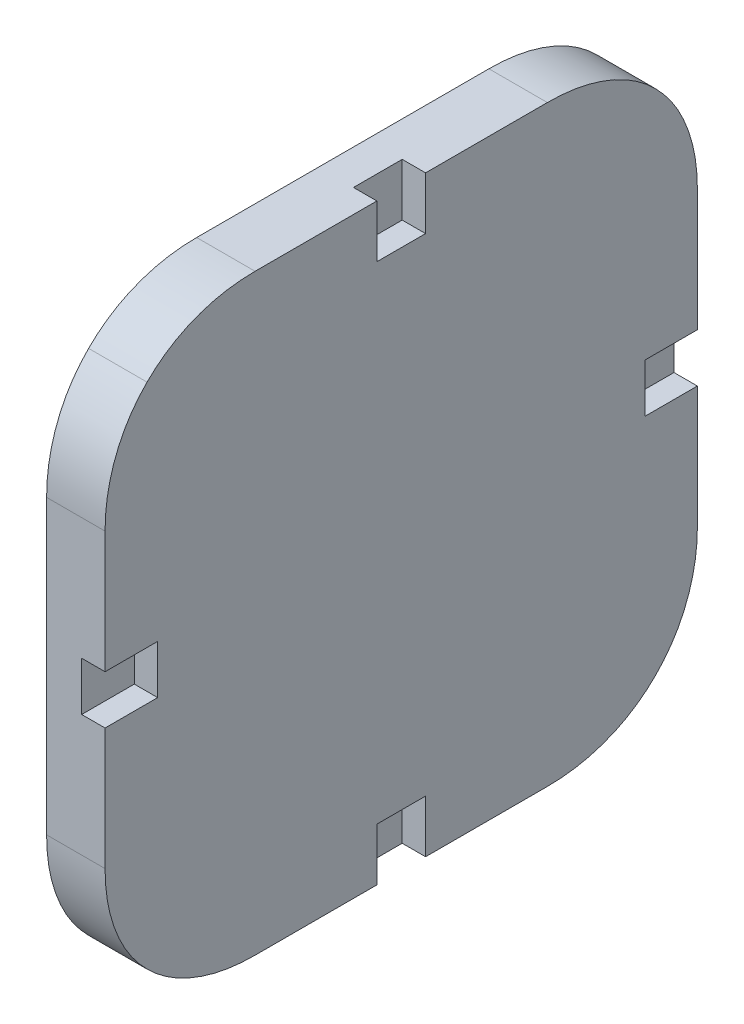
ISO-10303-21;
HEADER;
FILE_DESCRIPTION(('STEP AP214'),'2;1');
FILE_NAME('part.step','',(''),(''),'','','');
FILE_SCHEMA(('AUTOMOTIVE_DESIGN { 1 0 10303 214 1 1 1 1 }'));
ENDSEC;
DATA;
#1=APPLICATION_CONTEXT('core data for automotive mechanical design processes');
#2=APPLICATION_PROTOCOL_DEFINITION('international standard','automotive_design',2000,#1);
#3=PRODUCT_CONTEXT('',#1,'mechanical');
#4=PRODUCT('Part','Part','',(#3));
#5=PRODUCT_RELATED_PRODUCT_CATEGORY('part','',(#4));
#6=PRODUCT_DEFINITION_FORMATION('','',#4);
#7=PRODUCT_DEFINITION_CONTEXT('part definition',#1,'design');
#8=PRODUCT_DEFINITION('design','',#6,#7);
#9=PRODUCT_DEFINITION_SHAPE('','',#8);
#10=(LENGTH_UNIT() NAMED_UNIT(*) SI_UNIT(.MILLI.,.METRE.));
#11=(NAMED_UNIT(*) PLANE_ANGLE_UNIT() SI_UNIT($,.RADIAN.));
#12=(NAMED_UNIT(*) SI_UNIT($,.STERADIAN.) SOLID_ANGLE_UNIT());
#13=UNCERTAINTY_MEASURE_WITH_UNIT(LENGTH_MEASURE(1.E-05),#10,'distance_accuracy_value','');
#14=(GEOMETRIC_REPRESENTATION_CONTEXT(3) GLOBAL_UNCERTAINTY_ASSIGNED_CONTEXT((#13)) GLOBAL_UNIT_ASSIGNED_CONTEXT((#10,
#11,#12)) REPRESENTATION_CONTEXT('',''));
#15=CARTESIAN_POINT('',(0.,0.,0.));
#16=DIRECTION('',(0.,0.,1.));
#17=DIRECTION('',(1.,0.,0.));
#18=AXIS2_PLACEMENT_3D('',#15,#16,#17);
#19=CARTESIAN_POINT('',(20.5,32.1300644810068,10.6166229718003));
#20=DIRECTION('',(-1.,0.,0.));
#21=DIRECTION('',(0.,0.,1.));
#22=AXIS2_PLACEMENT_3D('',#19,#20,#21);
#23=PLANE('',#22);
#24=DIRECTION('',(0.,0.,-1.));
#25=VECTOR('',#24,1.);
#26=CARTESIAN_POINT('',(20.5,18.75,12.5));
#27=LINE('',#26,#25);
#28=CARTESIAN_POINT('',(20.5,18.75,15.2));
#29=VERTEX_POINT('',#28);
#30=CARTESIAN_POINT('',(20.5,18.75,12.5));
#31=VERTEX_POINT('',#30);
#32=EDGE_CURVE('E606',#29,#31,#27,.T.);
#33=ORIENTED_EDGE('',*,*,#32,.T.);
#34=DIRECTION('',(0.,-1.,0.));
#35=VECTOR('',#34,1.);
#36=CARTESIAN_POINT('',(20.5,18.75,12.5));
#37=LINE('',#36,#35);
#38=CARTESIAN_POINT('',(20.5,16.25,12.5));
#39=VERTEX_POINT('',#38);
#40=EDGE_CURVE('E601',#31,#39,#37,.T.);
#41=ORIENTED_EDGE('',*,*,#40,.T.);
#42=DIRECTION('',(0.,0.,1.));
#43=VECTOR('',#42,1.);
#44=CARTESIAN_POINT('',(20.5,16.25,12.5));
#45=LINE('',#44,#43);
#46=CARTESIAN_POINT('',(20.5,16.25,15.2));
#47=VERTEX_POINT('',#46);
#48=EDGE_CURVE('E604',#39,#47,#45,.T.);
#49=ORIENTED_EDGE('',*,*,#48,.T.);
#50=DIRECTION('',(0.,-1.,0.));
#51=VECTOR('',#50,1.);
#52=CARTESIAN_POINT('',(20.5,25.,15.2));
#53=LINE('',#52,#51);
#54=CARTESIAN_POINT('',(20.5,10.,15.2));
#55=VERTEX_POINT('',#54);
#56=EDGE_CURVE('E439',#47,#55,#53,.T.);
#57=ORIENTED_EDGE('',*,*,#56,.T.);
#58=CARTESIAN_POINT('',(20.5,10.,15.2));
#59=CARTESIAN_POINT('',(20.5,9.45802095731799,15.2));
#60=CARTESIAN_POINT('',(20.5,8.35553054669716,15.1065720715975));
#61=CARTESIAN_POINT('',(20.5,6.34909986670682,14.5244214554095));
#62=CARTESIAN_POINT('',(20.5,5.1383022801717,13.7287568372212));
#63=CARTESIAN_POINT('',(20.5,4.45477272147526,13.0452272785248));
#64=B_SPLINE_CURVE_WITH_KNOTS('',3,(#58,#59,#60,#61,#62,#63),.UNSPECIFIED.,.F.,.F.,(4,1,1,4),
(0.,0.25,0.5,1.),.UNSPECIFIED.);
#65=CARTESIAN_POINT('',(20.5,4.45477272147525,13.0452272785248));
#66=VERTEX_POINT('',#65);
#67=EDGE_CURVE('E436',#55,#66,#64,.T.);
#68=ORIENTED_EDGE('',*,*,#67,.T.);
#69=CARTESIAN_POINT('',(20.5,4.45477272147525,13.0452272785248));
#70=CARTESIAN_POINT('',(20.5,3.77123215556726,12.3616867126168));
#71=CARTESIAN_POINT('',(20.5,2.9758558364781,11.1572639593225));
#72=CARTESIAN_POINT('',(20.5,2.46578419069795,9.38667507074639));
#73=CARTESIAN_POINT('',(20.5,2.32408356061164,8.33370007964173));
#74=CARTESIAN_POINT('',(20.5,2.3,7.7755169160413));
#75=CARTESIAN_POINT('',(20.5,2.3,7.5));
#76=B_SPLINE_CURVE_WITH_KNOTS('',3,(#69,#70,#71,#72,#73,#74,#75),.UNSPECIFIED.,.F.,.F.,(4,1,1,1,
4),(0.,0.5,0.75,0.875,1.),.UNSPECIFIED.);
#77=CARTESIAN_POINT('',(20.5,2.3,7.5));
#78=VERTEX_POINT('',#77);
#79=EDGE_CURVE('E432',#66,#78,#76,.T.);
#80=ORIENTED_EDGE('',*,*,#79,.T.);
#81=DIRECTION('',(0.,0.,-1.));
#82=VECTOR('',#81,1.);
#83=CARTESIAN_POINT('',(20.5,2.3,7.5));
#84=LINE('',#83,#82);
#85=CARTESIAN_POINT('',(20.5,2.3,1.25));
#86=VERTEX_POINT('',#85);
#87=EDGE_CURVE('E883',#78,#86,#84,.T.);
#88=ORIENTED_EDGE('',*,*,#87,.T.);
#89=DIRECTION('',(0.,1.,0.));
#90=VECTOR('',#89,1.);
#91=CARTESIAN_POINT('',(20.5,5.,1.25));
#92=LINE('',#91,#90);
#93=CARTESIAN_POINT('',(20.5,5.,1.25));
#94=VERTEX_POINT('',#93);
#95=EDGE_CURVE('E557',#86,#94,#92,.T.);
#96=ORIENTED_EDGE('',*,*,#95,.T.);
#97=DIRECTION('',(0.,0.,-1.));
#98=VECTOR('',#97,1.);
#99=CARTESIAN_POINT('',(20.5,5.,1.25));
#100=LINE('',#99,#98);
#101=CARTESIAN_POINT('',(20.5,5.,-1.25));
#102=VERTEX_POINT('',#101);
#103=EDGE_CURVE('E550',#94,#102,#100,.T.);
#104=ORIENTED_EDGE('',*,*,#103,.T.);
#105=DIRECTION('',(0.,-1.,0.));
#106=VECTOR('',#105,1.);
#107=CARTESIAN_POINT('',(20.5,5.,-1.25));
#108=LINE('',#107,#106);
#109=CARTESIAN_POINT('',(20.5,2.3,-1.25));
#110=VERTEX_POINT('',#109);
#111=EDGE_CURVE('E554',#102,#110,#108,.T.);
#112=ORIENTED_EDGE('',*,*,#111,.T.);
#113=CARTESIAN_POINT('',(20.5,2.3,-7.5));
#114=VERTEX_POINT('',#113);
#115=EDGE_CURVE('E425',#110,#114,#84,.T.);
#116=ORIENTED_EDGE('',*,*,#115,.T.);
#117=CARTESIAN_POINT('',(20.5,2.3,-7.5));
#118=CARTESIAN_POINT('',(20.5,2.3,-8.04197904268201));
#119=CARTESIAN_POINT('',(20.5,2.39342792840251,-9.14446945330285));
#120=CARTESIAN_POINT('',(20.5,2.97557854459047,-11.1509001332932));
#121=CARTESIAN_POINT('',(20.5,3.77124316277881,-12.3616977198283));
#122=CARTESIAN_POINT('',(20.5,4.45477272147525,-13.0452272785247));
#123=B_SPLINE_CURVE_WITH_KNOTS('',3,(#117,#118,#119,#120,#121,#122),.UNSPECIFIED.,.F.,.F.,(4,1,
1,4),(0.,0.25,0.5,1.),.UNSPECIFIED.);
#124=CARTESIAN_POINT('',(20.5,4.45477272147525,-13.0452272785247));
#125=VERTEX_POINT('',#124);
#126=EDGE_CURVE('E419',#114,#125,#123,.T.);
#127=ORIENTED_EDGE('',*,*,#126,.T.);
#128=CARTESIAN_POINT('',(20.5,4.45477272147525,-13.0452272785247));
#129=CARTESIAN_POINT('',(20.5,5.13831328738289,-13.7287678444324));
#130=CARTESIAN_POINT('',(20.5,6.34273604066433,-14.5241441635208));
#131=CARTESIAN_POINT('',(20.5,8.11332492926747,-15.0342158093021));
#132=CARTESIAN_POINT('',(20.5,9.16629992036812,-15.1759164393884));
#133=CARTESIAN_POINT('',(20.5,9.72448308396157,-15.2));
#134=CARTESIAN_POINT('',(20.5,10.,-15.2));
#135=B_SPLINE_CURVE_WITH_KNOTS('',3,(#128,#129,#130,#131,#132,#133,#134),.UNSPECIFIED.,.F.,.F.,
(4,1,1,1,4),(0.,0.5,0.75,0.875,1.),.UNSPECIFIED.);
#136=CARTESIAN_POINT('',(20.5,10.,-15.2));
#137=VERTEX_POINT('',#136);
#138=EDGE_CURVE('E413',#125,#137,#135,.T.);
#139=ORIENTED_EDGE('',*,*,#138,.T.);
#140=DIRECTION('',(0.,1.,0.));
#141=VECTOR('',#140,1.);
#142=CARTESIAN_POINT('',(20.5,10.,-15.2));
#143=LINE('',#142,#141);
#144=CARTESIAN_POINT('',(20.5,16.25,-15.2));
#145=VERTEX_POINT('',#144);
#146=EDGE_CURVE('E409',#137,#145,#143,.T.);
#147=ORIENTED_EDGE('',*,*,#146,.T.);
#148=DIRECTION('',(0.,0.,-1.));
#149=VECTOR('',#148,1.);
#150=CARTESIAN_POINT('',(20.5,16.25,-12.5));
#151=LINE('',#150,#149);
#152=CARTESIAN_POINT('',(20.5,16.25,-12.5));
#153=VERTEX_POINT('',#152);
#154=EDGE_CURVE('E577',#153,#145,#151,.T.);
#155=ORIENTED_EDGE('',*,*,#154,.F.);
#156=DIRECTION('',(0.,-1.,0.));
#157=VECTOR('',#156,1.);
#158=CARTESIAN_POINT('',(20.5,18.75,-12.5));
#159=LINE('',#158,#157);
#160=CARTESIAN_POINT('',(20.5,18.75,-12.5));
#161=VERTEX_POINT('',#160);
#162=EDGE_CURVE('E580',#161,#153,#159,.T.);
#163=ORIENTED_EDGE('',*,*,#162,.F.);
#164=DIRECTION('',(0.,0.,1.));
#165=VECTOR('',#164,1.);
#166=CARTESIAN_POINT('',(20.5,18.75,-12.5));
#167=LINE('',#166,#165);
#168=CARTESIAN_POINT('',(20.5,18.75,-15.2));
#169=VERTEX_POINT('',#168);
#170=EDGE_CURVE('E583',#169,#161,#167,.T.);
#171=ORIENTED_EDGE('',*,*,#170,.F.);
#172=CARTESIAN_POINT('',(20.5,25.,-15.2));
#173=VERTEX_POINT('',#172);
#174=EDGE_CURVE('E870',#169,#173,#143,.T.);
#175=ORIENTED_EDGE('',*,*,#174,.T.);
#176=CARTESIAN_POINT('',(20.5,25.,-15.2));
#177=CARTESIAN_POINT('',(20.5,25.5419790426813,-15.2));
#178=CARTESIAN_POINT('',(20.5,26.644469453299,-15.1065720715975));
#179=CARTESIAN_POINT('',(20.5,28.650900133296,-14.5244214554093));
#180=CARTESIAN_POINT('',(20.5,29.8616977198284,-13.7287568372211));
#181=CARTESIAN_POINT('',(20.5,30.5452272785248,-13.0452272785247));
#182=B_SPLINE_CURVE_WITH_KNOTS('',3,(#176,#177,#178,#179,#180,#181),.UNSPECIFIED.,.F.,.F.,(4,1,
1,4),(0.,0.25,0.5,1.),.UNSPECIFIED.);
#183=CARTESIAN_POINT('',(20.5,30.5452272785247,-13.0452272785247));
#184=VERTEX_POINT('',#183);
#185=EDGE_CURVE('E493',#173,#184,#182,.T.);
#186=ORIENTED_EDGE('',*,*,#185,.T.);
#187=CARTESIAN_POINT('',(20.5,30.5452272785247,-13.0452272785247));
#188=CARTESIAN_POINT('',(20.5,31.2287678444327,-12.3616867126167));
#189=CARTESIAN_POINT('',(20.5,32.0241441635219,-11.1572639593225));
#190=CARTESIAN_POINT('',(20.5,32.534215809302,-9.38667507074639));
#191=CARTESIAN_POINT('',(20.5,32.6759164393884,-8.33370007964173));
#192=CARTESIAN_POINT('',(20.5,32.7,-7.7755169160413));
#193=CARTESIAN_POINT('',(20.5,32.7,-7.5));
#194=B_SPLINE_CURVE_WITH_KNOTS('',3,(#187,#188,#189,#190,#191,#192,#193),.UNSPECIFIED.,.F.,.F.,
(4,1,1,1,4),(0.,0.5,0.75,0.875,1.),.UNSPECIFIED.);
#195=CARTESIAN_POINT('',(20.5,32.7,-7.5));
#196=VERTEX_POINT('',#195);
#197=EDGE_CURVE('E488',#184,#196,#194,.T.);
#198=ORIENTED_EDGE('',*,*,#197,.T.);
#199=DIRECTION('',(0.,0.,1.));
#200=VECTOR('',#199,1.);
#201=CARTESIAN_POINT('',(20.5,32.7,-7.5));
#202=LINE('',#201,#200);
#203=CARTESIAN_POINT('',(20.5,32.7,-1.25));
#204=VERTEX_POINT('',#203);
#205=EDGE_CURVE('E293',#196,#204,#202,.T.);
#206=ORIENTED_EDGE('',*,*,#205,.T.);
#207=DIRECTION('',(0.,1.,0.));
#208=VECTOR('',#207,1.);
#209=CARTESIAN_POINT('',(20.5,30.,-1.25));
#210=LINE('',#209,#208);
#211=CARTESIAN_POINT('',(20.5,30.,-1.25));
#212=VERTEX_POINT('',#211);
#213=EDGE_CURVE('E523',#212,#204,#210,.T.);
#214=ORIENTED_EDGE('',*,*,#213,.F.);
#215=DIRECTION('',(0.,0.,-1.));
#216=VECTOR('',#215,1.);
#217=CARTESIAN_POINT('',(20.5,30.,1.25));
#218=LINE('',#217,#216);
#219=CARTESIAN_POINT('',(20.5,30.,1.25));
#220=VERTEX_POINT('',#219);
#221=EDGE_CURVE('E526',#220,#212,#218,.T.);
#222=ORIENTED_EDGE('',*,*,#221,.F.);
#223=DIRECTION('',(0.,-1.,0.));
#224=VECTOR('',#223,1.);
#225=CARTESIAN_POINT('',(20.5,30.,1.25));
#226=LINE('',#225,#224);
#227=CARTESIAN_POINT('',(20.5,32.7,1.25));
#228=VERTEX_POINT('',#227);
#229=EDGE_CURVE('E505',#228,#220,#226,.T.);
#230=ORIENTED_EDGE('',*,*,#229,.F.);
#231=CARTESIAN_POINT('',(20.5,32.7,7.5));
#232=VERTEX_POINT('',#231);
#233=EDGE_CURVE('E492',#228,#232,#202,.T.);
#234=ORIENTED_EDGE('',*,*,#233,.T.);
#235=CARTESIAN_POINT('',(20.5,32.7,7.5));
#236=CARTESIAN_POINT('',(20.5,32.7,8.04197904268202));
#237=CARTESIAN_POINT('',(20.5,32.6065720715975,9.14446945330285));
#238=CARTESIAN_POINT('',(20.5,32.0244214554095,11.1509001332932));
#239=CARTESIAN_POINT('',(20.5,31.2287568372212,12.3616977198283));
#240=CARTESIAN_POINT('',(20.5,30.5452272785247,13.0452272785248));
#241=B_SPLINE_CURVE_WITH_KNOTS('',3,(#235,#236,#237,#238,#239,#240),.UNSPECIFIED.,.F.,.F.,(4,1,
1,4),(0.,0.25,0.5,1.),.UNSPECIFIED.);
#242=CARTESIAN_POINT('',(20.5,30.5452272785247,13.0452272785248));
#243=VERTEX_POINT('',#242);
#244=EDGE_CURVE('E276',#232,#243,#241,.T.);
#245=ORIENTED_EDGE('',*,*,#244,.T.);
#246=CARTESIAN_POINT('',(20.5,30.5452272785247,13.0452272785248));
#247=CARTESIAN_POINT('',(20.5,29.8616867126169,13.7287678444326));
#248=CARTESIAN_POINT('',(20.5,28.6572639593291,14.5241441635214));
#249=CARTESIAN_POINT('',(20.5,26.8866750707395,15.0342158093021));
#250=CARTESIAN_POINT('',(20.5,25.8337000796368,15.1759164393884));
#251=CARTESIAN_POINT('',(20.5,25.2755169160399,15.2));
#252=CARTESIAN_POINT('',(20.5,25.,15.2));
#253=B_SPLINE_CURVE_WITH_KNOTS('',3,(#246,#247,#248,#249,#250,#251,#252),.UNSPECIFIED.,.F.,.F.,
(4,1,1,1,4),(0.,0.5,0.75,0.875,1.),.UNSPECIFIED.);
#254=CARTESIAN_POINT('',(20.5,25.,15.2));
#255=VERTEX_POINT('',#254);
#256=EDGE_CURVE('E333',#243,#255,#253,.T.);
#257=ORIENTED_EDGE('',*,*,#256,.T.);
#258=EDGE_CURVE('E329',#255,#29,#53,.T.);
#259=ORIENTED_EDGE('',*,*,#258,.T.);
#260=EDGE_LOOP('',(#33,#41,#49,#57,#68,#80,#88,#96,#104,#112,#116,#127,#139,#147,#155,#163,#171,
#175,#186,#198,#206,#214,#222,#230,#234,#245,#257,#259));
#261=FACE_BOUND('',#260,.T.);
#262=ADVANCED_FACE('F77',(#261),#23,.F.);
#263=CARTESIAN_POINT('',(20.5,25.,15.2));
#264=DIRECTION('',(0.,0.,-1.));
#265=DIRECTION('',(-1.,0.,0.));
#266=AXIS2_PLACEMENT_3D('',#263,#264,#265);
#267=PLANE('',#266);
#268=DIRECTION('',(1.,0.,0.));
#269=VECTOR('',#268,1.);
#270=CARTESIAN_POINT('',(19.3,18.75,15.2));
#271=LINE('',#270,#269);
#272=CARTESIAN_POINT('',(19.3,18.75,15.2));
#273=VERTEX_POINT('',#272);
#274=EDGE_CURVE('E593',#273,#29,#271,.T.);
#275=ORIENTED_EDGE('',*,*,#274,.T.);
#276=ORIENTED_EDGE('',*,*,#258,.F.);
#277=DIRECTION('',(-1.,0.,0.));
#278=VECTOR('',#277,1.);
#279=CARTESIAN_POINT('',(20.5,25.,15.2));
#280=LINE('',#279,#278);
#281=CARTESIAN_POINT('',(17.5,25.,15.2));
#282=VERTEX_POINT('',#281);
#283=EDGE_CURVE('E86',#255,#282,#280,.T.);
#284=ORIENTED_EDGE('',*,*,#283,.T.);
#285=DIRECTION('',(0.,-1.,0.));
#286=VECTOR('',#285,1.);
#287=CARTESIAN_POINT('',(17.5,25.,15.2));
#288=LINE('',#287,#286);
#289=CARTESIAN_POINT('',(17.5,10.,15.2));
#290=VERTEX_POINT('',#289);
#291=EDGE_CURVE('E327',#282,#290,#288,.T.);
#292=ORIENTED_EDGE('',*,*,#291,.T.);
#293=DIRECTION('',(-1.,0.,0.));
#294=VECTOR('',#293,1.);
#295=CARTESIAN_POINT('',(20.5,10.,15.2));
#296=LINE('',#295,#294);
#297=EDGE_CURVE('E317',#55,#290,#296,.T.);
#298=ORIENTED_EDGE('',*,*,#297,.F.);
#299=ORIENTED_EDGE('',*,*,#56,.F.);
#300=DIRECTION('',(1.,0.,0.));
#301=VECTOR('',#300,1.);
#302=CARTESIAN_POINT('',(19.3,16.25,15.2));
#303=LINE('',#302,#301);
#304=CARTESIAN_POINT('',(19.3,16.25,15.2));
#305=VERTEX_POINT('',#304);
#306=EDGE_CURVE('E441',#305,#47,#303,.T.);
#307=ORIENTED_EDGE('',*,*,#306,.F.);
#308=DIRECTION('',(0.,1.,0.));
#309=VECTOR('',#308,1.);
#310=CARTESIAN_POINT('',(19.3,18.75,15.2));
#311=LINE('',#310,#309);
#312=EDGE_CURVE('E611',#305,#273,#311,.T.);
#313=ORIENTED_EDGE('',*,*,#312,.T.);
#314=EDGE_LOOP('',(#275,#276,#284,#292,#298,#299,#307,#313));
#315=FACE_BOUND('',#314,.T.);
#316=ADVANCED_FACE('F325',(#315),#267,.F.);
#317=CARTESIAN_POINT('',(20.5,2.3,7.5));
#318=DIRECTION('',(0.,1.,0.));
#319=DIRECTION('',(0.,0.,1.));
#320=AXIS2_PLACEMENT_3D('',#317,#318,#319);
#321=PLANE('',#320);
#322=DIRECTION('',(1.,0.,0.));
#323=VECTOR('',#322,1.);
#324=CARTESIAN_POINT('',(19.3,2.30000000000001,1.25));
#325=LINE('',#324,#323);
#326=CARTESIAN_POINT('',(19.3,2.30000000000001,1.25));
#327=VERTEX_POINT('',#326);
#328=EDGE_CURVE('E541',#327,#86,#325,.T.);
#329=ORIENTED_EDGE('',*,*,#328,.T.);
#330=ORIENTED_EDGE('',*,*,#87,.F.);
#331=DIRECTION('',(-1.,0.,0.));
#332=VECTOR('',#331,1.);
#333=CARTESIAN_POINT('',(20.5,2.3,7.5));
#334=LINE('',#333,#332);
#335=CARTESIAN_POINT('',(17.5,2.3,7.5));
#336=VERTEX_POINT('',#335);
#337=EDGE_CURVE('E311',#78,#336,#334,.T.);
#338=ORIENTED_EDGE('',*,*,#337,.T.);
#339=DIRECTION('',(0.,0.,-1.));
#340=VECTOR('',#339,1.);
#341=CARTESIAN_POINT('',(17.5,2.3,7.5));
#342=LINE('',#341,#340);
#343=CARTESIAN_POINT('',(17.5,2.3,-7.5));
#344=VERTEX_POINT('',#343);
#345=EDGE_CURVE('E363',#336,#344,#342,.T.);
#346=ORIENTED_EDGE('',*,*,#345,.T.);
#347=DIRECTION('',(-1.,0.,0.));
#348=VECTOR('',#347,1.);
#349=CARTESIAN_POINT('',(20.5,2.3,-7.5));
#350=LINE('',#349,#348);
#351=EDGE_CURVE('E308',#114,#344,#350,.T.);
#352=ORIENTED_EDGE('',*,*,#351,.F.);
#353=ORIENTED_EDGE('',*,*,#115,.F.);
#354=DIRECTION('',(1.,0.,0.));
#355=VECTOR('',#354,1.);
#356=CARTESIAN_POINT('',(19.3,2.30000000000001,-1.25));
#357=LINE('',#356,#355);
#358=CARTESIAN_POINT('',(19.3,2.30000000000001,-1.25));
#359=VERTEX_POINT('',#358);
#360=EDGE_CURVE('E543',#359,#110,#357,.T.);
#361=ORIENTED_EDGE('',*,*,#360,.F.);
#362=DIRECTION('',(0.,0.,1.));
#363=VECTOR('',#362,1.);
#364=CARTESIAN_POINT('',(19.3,2.30000000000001,1.25));
#365=LINE('',#364,#363);
#366=EDGE_CURVE('E564',#359,#327,#365,.T.);
#367=ORIENTED_EDGE('',*,*,#366,.T.);
#368=EDGE_LOOP('',(#329,#330,#338,#346,#352,#353,#361,#367));
#369=FACE_BOUND('',#368,.T.);
#370=ADVANCED_FACE('F423',(#369),#321,.F.);
#371=DIRECTION('',(-1.,0.,0.));
#372=VECTOR('',#371,1.);
#373=SURFACE_OF_LINEAR_EXTRUSION('',#241,#372);
#374=CARTESIAN_POINT('',(17.5,32.7,7.5));
#375=CARTESIAN_POINT('',(17.5,32.7,8.04197904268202));
#376=CARTESIAN_POINT('',(17.5,32.6065720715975,9.14446945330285));
#377=CARTESIAN_POINT('',(17.5,32.0244214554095,11.1509001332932));
#378=CARTESIAN_POINT('',(17.5,31.2287568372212,12.3616977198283));
#379=CARTESIAN_POINT('',(17.5,30.5452272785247,13.0452272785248));
#380=B_SPLINE_CURVE_WITH_KNOTS('',3,(#374,#375,#376,#377,#378,#379),.UNSPECIFIED.,.F.,.F.,(4,1,
1,4),(0.,0.25,0.5,1.),.UNSPECIFIED.);
#381=CARTESIAN_POINT('',(17.5,32.7,7.5));
#382=VERTEX_POINT('',#381);
#383=CARTESIAN_POINT('',(17.5,30.5452272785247,13.0452272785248));
#384=VERTEX_POINT('',#383);
#385=EDGE_CURVE('E271',#382,#384,#380,.T.);
#386=ORIENTED_EDGE('',*,*,#385,.T.);
#387=DIRECTION('',(-1.,0.,0.));
#388=VECTOR('',#387,1.);
#389=CARTESIAN_POINT('',(20.5,30.5452272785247,13.0452272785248));
#390=LINE('',#389,#388);
#391=EDGE_CURVE('E13',#243,#384,#390,.T.);
#392=ORIENTED_EDGE('',*,*,#391,.F.);
#393=ORIENTED_EDGE('',*,*,#244,.F.);
#394=DIRECTION('',(-1.,0.,0.));
#395=VECTOR('',#394,1.);
#396=CARTESIAN_POINT('',(20.5,32.7,7.5));
#397=LINE('',#396,#395);
#398=EDGE_CURVE('E294',#232,#382,#397,.T.);
#399=ORIENTED_EDGE('',*,*,#398,.T.);
#400=EDGE_LOOP('',(#386,#392,#393,#399));
#401=FACE_BOUND('',#400,.T.);
#402=ADVANCED_FACE('F79',(#401),#373,.F.);
#403=DIRECTION('',(-1.,0.,0.));
#404=VECTOR('',#403,1.);
#405=SURFACE_OF_LINEAR_EXTRUSION('',#253,#404);
#406=CARTESIAN_POINT('',(17.5,30.5452272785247,13.0452272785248));
#407=CARTESIAN_POINT('',(17.5,29.8616867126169,13.7287678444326));
#408=CARTESIAN_POINT('',(17.5,28.6572639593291,14.5241441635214));
#409=CARTESIAN_POINT('',(17.5,26.8866750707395,15.0342158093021));
#410=CARTESIAN_POINT('',(17.5,25.8337000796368,15.1759164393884));
#411=CARTESIAN_POINT('',(17.5,25.2755169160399,15.2));
#412=CARTESIAN_POINT('',(17.5,25.,15.2));
#413=B_SPLINE_CURVE_WITH_KNOTS('',3,(#406,#407,#408,#409,#410,#411,#412),.UNSPECIFIED.,.F.,.F.,
(4,1,1,1,4),(0.,0.5,0.75,0.875,1.),.UNSPECIFIED.);
#414=EDGE_CURVE('E335',#384,#282,#413,.T.);
#415=ORIENTED_EDGE('',*,*,#414,.T.);
#416=ORIENTED_EDGE('',*,*,#283,.F.);
#417=ORIENTED_EDGE('',*,*,#256,.F.);
#418=ORIENTED_EDGE('',*,*,#391,.T.);
#419=EDGE_LOOP('',(#415,#416,#417,#418));
#420=FACE_BOUND('',#419,.T.);
#421=ADVANCED_FACE('F332',(#420),#405,.F.);
#422=DIRECTION('',(-1.,0.,0.));
#423=VECTOR('',#422,1.);
#424=SURFACE_OF_LINEAR_EXTRUSION('',#64,#423);
#425=CARTESIAN_POINT('',(17.5,10.,15.2));
#426=CARTESIAN_POINT('',(17.5,9.45802095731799,15.2));
#427=CARTESIAN_POINT('',(17.5,8.35553054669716,15.1065720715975));
#428=CARTESIAN_POINT('',(17.5,6.34909986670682,14.5244214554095));
#429=CARTESIAN_POINT('',(17.5,5.1383022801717,13.7287568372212));
#430=CARTESIAN_POINT('',(17.5,4.45477272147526,13.0452272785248));
#431=B_SPLINE_CURVE_WITH_KNOTS('',3,(#425,#426,#427,#428,#429,#430),.UNSPECIFIED.,.F.,.F.,(4,1,
1,4),(0.,0.25,0.5,1.),.UNSPECIFIED.);
#432=CARTESIAN_POINT('',(17.5,4.45477272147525,13.0452272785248));
#433=VERTEX_POINT('',#432);
#434=EDGE_CURVE('E338',#290,#433,#431,.T.);
#435=ORIENTED_EDGE('',*,*,#434,.T.);
#436=DIRECTION('',(-1.,0.,0.));
#437=VECTOR('',#436,1.);
#438=CARTESIAN_POINT('',(20.5,4.45477272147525,13.0452272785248));
#439=LINE('',#438,#437);
#440=EDGE_CURVE('E314',#66,#433,#439,.T.);
#441=ORIENTED_EDGE('',*,*,#440,.F.);
#442=ORIENTED_EDGE('',*,*,#67,.F.);
#443=ORIENTED_EDGE('',*,*,#297,.T.);
#444=EDGE_LOOP('',(#435,#441,#442,#443));
#445=FACE_BOUND('',#444,.T.);
#446=ADVANCED_FACE('F435',(#445),#424,.F.);
#447=DIRECTION('',(-1.,0.,0.));
#448=VECTOR('',#447,1.);
#449=SURFACE_OF_LINEAR_EXTRUSION('',#76,#448);
#450=CARTESIAN_POINT('',(17.5,4.45477272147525,13.0452272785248));
#451=CARTESIAN_POINT('',(17.5,3.77123215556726,12.3616867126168));
#452=CARTESIAN_POINT('',(17.5,2.9758558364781,11.1572639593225));
#453=CARTESIAN_POINT('',(17.5,2.46578419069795,9.38667507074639));
#454=CARTESIAN_POINT('',(17.5,2.32408356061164,8.33370007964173));
#455=CARTESIAN_POINT('',(17.5,2.3,7.7755169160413));
#456=CARTESIAN_POINT('',(17.5,2.3,7.5));
#457=B_SPLINE_CURVE_WITH_KNOTS('',3,(#450,#451,#452,#453,#454,#455,#456),.UNSPECIFIED.,.F.,.F.,
(4,1,1,1,4),(0.,0.5,0.75,0.875,1.),.UNSPECIFIED.);
#458=EDGE_CURVE('E355',#433,#336,#457,.T.);
#459=ORIENTED_EDGE('',*,*,#458,.T.);
#460=ORIENTED_EDGE('',*,*,#337,.F.);
#461=ORIENTED_EDGE('',*,*,#79,.F.);
#462=ORIENTED_EDGE('',*,*,#440,.T.);
#463=EDGE_LOOP('',(#459,#460,#461,#462));
#464=FACE_BOUND('',#463,.T.);
#465=ADVANCED_FACE('F429',(#464),#449,.F.);
#466=DIRECTION('',(-1.,0.,0.));
#467=VECTOR('',#466,1.);
#468=SURFACE_OF_LINEAR_EXTRUSION('',#123,#467);
#469=CARTESIAN_POINT('',(17.5,2.3,-7.5));
#470=CARTESIAN_POINT('',(17.5,2.3,-8.04197904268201));
#471=CARTESIAN_POINT('',(17.5,2.39342792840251,-9.14446945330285));
#472=CARTESIAN_POINT('',(17.5,2.97557854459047,-11.1509001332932));
#473=CARTESIAN_POINT('',(17.5,3.77124316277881,-12.3616977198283));
#474=CARTESIAN_POINT('',(17.5,4.45477272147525,-13.0452272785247));
#475=B_SPLINE_CURVE_WITH_KNOTS('',3,(#469,#470,#471,#472,#473,#474),.UNSPECIFIED.,.F.,.F.,(4,1,
1,4),(0.,0.25,0.5,1.),.UNSPECIFIED.);
#476=CARTESIAN_POINT('',(17.5,4.45477272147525,-13.0452272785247));
#477=VERTEX_POINT('',#476);
#478=EDGE_CURVE('E369',#344,#477,#475,.T.);
#479=ORIENTED_EDGE('',*,*,#478,.T.);
#480=DIRECTION('',(-1.,0.,0.));
#481=VECTOR('',#480,1.);
#482=CARTESIAN_POINT('',(20.5,4.45477272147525,-13.0452272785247));
#483=LINE('',#482,#481);
#484=EDGE_CURVE('E305',#125,#477,#483,.T.);
#485=ORIENTED_EDGE('',*,*,#484,.F.);
#486=ORIENTED_EDGE('',*,*,#126,.F.);
#487=ORIENTED_EDGE('',*,*,#351,.T.);
#488=EDGE_LOOP('',(#479,#485,#486,#487));
#489=FACE_BOUND('',#488,.T.);
#490=ADVANCED_FACE('F416',(#489),#468,.F.);
#491=DIRECTION('',(-1.,0.,0.));
#492=VECTOR('',#491,1.);
#493=SURFACE_OF_LINEAR_EXTRUSION('',#135,#492);
#494=CARTESIAN_POINT('',(17.5,4.45477272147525,-13.0452272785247));
#495=CARTESIAN_POINT('',(17.5,5.13831328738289,-13.7287678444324));
#496=CARTESIAN_POINT('',(17.5,6.34273604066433,-14.5241441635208));
#497=CARTESIAN_POINT('',(17.5,8.11332492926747,-15.0342158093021));
#498=CARTESIAN_POINT('',(17.5,9.16629992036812,-15.1759164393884));
#499=CARTESIAN_POINT('',(17.5,9.72448308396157,-15.2));
#500=CARTESIAN_POINT('',(17.5,10.,-15.2));
#501=B_SPLINE_CURVE_WITH_KNOTS('',3,(#494,#495,#496,#497,#498,#499,#500),.UNSPECIFIED.,.F.,.F.,
(4,1,1,1,4),(0.,0.5,0.75,0.875,1.),.UNSPECIFIED.);
#502=CARTESIAN_POINT('',(17.5,10.,-15.2));
#503=VERTEX_POINT('',#502);
#504=EDGE_CURVE('E374',#477,#503,#501,.T.);
#505=ORIENTED_EDGE('',*,*,#504,.T.);
#506=DIRECTION('',(-1.,0.,0.));
#507=VECTOR('',#506,1.);
#508=CARTESIAN_POINT('',(20.5,10.,-15.2));
#509=LINE('',#508,#507);
#510=EDGE_CURVE('E302',#137,#503,#509,.T.);
#511=ORIENTED_EDGE('',*,*,#510,.F.);
#512=ORIENTED_EDGE('',*,*,#138,.F.);
#513=ORIENTED_EDGE('',*,*,#484,.T.);
#514=EDGE_LOOP('',(#505,#511,#512,#513));
#515=FACE_BOUND('',#514,.T.);
#516=ADVANCED_FACE('F412',(#515),#493,.F.);
#517=CARTESIAN_POINT('',(20.5,10.,-15.2));
#518=DIRECTION('',(0.,0.,1.));
#519=DIRECTION('',(1.,0.,0.));
#520=AXIS2_PLACEMENT_3D('',#517,#518,#519);
#521=PLANE('',#520);
#522=ORIENTED_EDGE('',*,*,#174,.F.);
#523=DIRECTION('',(1.,0.,0.));
#524=VECTOR('',#523,1.);
#525=CARTESIAN_POINT('',(19.3,18.75,-15.2));
#526=LINE('',#525,#524);
#527=CARTESIAN_POINT('',(19.3,18.75,-15.2));
#528=VERTEX_POINT('',#527);
#529=EDGE_CURVE('E560',#528,#169,#526,.T.);
#530=ORIENTED_EDGE('',*,*,#529,.F.);
#531=DIRECTION('',(0.,1.,0.));
#532=VECTOR('',#531,1.);
#533=CARTESIAN_POINT('',(19.3,18.75,-15.2));
#534=LINE('',#533,#532);
#535=CARTESIAN_POINT('',(19.3,16.25,-15.2));
#536=VERTEX_POINT('',#535);
#537=EDGE_CURVE('E572',#536,#528,#534,.T.);
#538=ORIENTED_EDGE('',*,*,#537,.F.);
#539=DIRECTION('',(1.,0.,0.));
#540=VECTOR('',#539,1.);
#541=CARTESIAN_POINT('',(19.3,16.25,-15.2));
#542=LINE('',#541,#540);
#543=EDGE_CURVE('E574',#536,#145,#542,.T.);
#544=ORIENTED_EDGE('',*,*,#543,.T.);
#545=ORIENTED_EDGE('',*,*,#146,.F.);
#546=ORIENTED_EDGE('',*,*,#510,.T.);
#547=DIRECTION('',(0.,1.,0.));
#548=VECTOR('',#547,1.);
#549=CARTESIAN_POINT('',(17.5,10.,-15.2));
#550=LINE('',#549,#548);
#551=CARTESIAN_POINT('',(17.5,25.,-15.2));
#552=VERTEX_POINT('',#551);
#553=EDGE_CURVE('E382',#503,#552,#550,.T.);
#554=ORIENTED_EDGE('',*,*,#553,.T.);
#555=DIRECTION('',(-1.,0.,0.));
#556=VECTOR('',#555,1.);
#557=CARTESIAN_POINT('',(20.5,25.,-15.2));
#558=LINE('',#557,#556);
#559=EDGE_CURVE('E296',#173,#552,#558,.T.);
#560=ORIENTED_EDGE('',*,*,#559,.F.);
#561=EDGE_LOOP('',(#522,#530,#538,#544,#545,#546,#554,#560));
#562=FACE_BOUND('',#561,.T.);
#563=ADVANCED_FACE('F404',(#562),#521,.F.);
#564=DIRECTION('',(-1.,0.,0.));
#565=VECTOR('',#564,1.);
#566=SURFACE_OF_LINEAR_EXTRUSION('',#182,#565);
#567=CARTESIAN_POINT('',(17.5,25.,-15.2));
#568=CARTESIAN_POINT('',(17.5,25.5419790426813,-15.2));
#569=CARTESIAN_POINT('',(17.5,26.644469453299,-15.1065720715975));
#570=CARTESIAN_POINT('',(17.5,28.650900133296,-14.5244214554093));
#571=CARTESIAN_POINT('',(17.5,29.8616977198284,-13.7287568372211));
#572=CARTESIAN_POINT('',(17.5,30.5452272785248,-13.0452272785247));
#573=B_SPLINE_CURVE_WITH_KNOTS('',3,(#567,#568,#569,#570,#571,#572),.UNSPECIFIED.,.F.,.F.,(4,1,
1,4),(0.,0.25,0.5,1.),.UNSPECIFIED.);
#574=CARTESIAN_POINT('',(17.5,30.5452272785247,-13.0452272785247));
#575=VERTEX_POINT('',#574);
#576=EDGE_CURVE('E287',#552,#575,#573,.T.);
#577=ORIENTED_EDGE('',*,*,#576,.T.);
#578=DIRECTION('',(-1.,0.,0.));
#579=VECTOR('',#578,1.);
#580=CARTESIAN_POINT('',(20.5,30.5452272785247,-13.0452272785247));
#581=LINE('',#580,#579);
#582=EDGE_CURVE('E286',#184,#575,#581,.T.);
#583=ORIENTED_EDGE('',*,*,#582,.F.);
#584=ORIENTED_EDGE('',*,*,#185,.F.);
#585=ORIENTED_EDGE('',*,*,#559,.T.);
#586=EDGE_LOOP('',(#577,#583,#584,#585));
#587=FACE_BOUND('',#586,.T.);
#588=ADVANCED_FACE('F399',(#587),#566,.F.);
#589=DIRECTION('',(-1.,0.,0.));
#590=VECTOR('',#589,1.);
#591=SURFACE_OF_LINEAR_EXTRUSION('',#194,#590);
#592=CARTESIAN_POINT('',(17.5,30.5452272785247,-13.0452272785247));
#593=CARTESIAN_POINT('',(17.5,31.2287678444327,-12.3616867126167));
#594=CARTESIAN_POINT('',(17.5,32.0241441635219,-11.1572639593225));
#595=CARTESIAN_POINT('',(17.5,32.534215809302,-9.38667507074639));
#596=CARTESIAN_POINT('',(17.5,32.6759164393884,-8.33370007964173));
#597=CARTESIAN_POINT('',(17.5,32.7,-7.7755169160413));
#598=CARTESIAN_POINT('',(17.5,32.7,-7.5));
#599=B_SPLINE_CURVE_WITH_KNOTS('',3,(#592,#593,#594,#595,#596,#597,#598),.UNSPECIFIED.,.F.,.F.,
(4,1,1,1,4),(0.,0.5,0.75,0.875,1.),.UNSPECIFIED.);
#600=CARTESIAN_POINT('',(17.5,32.7,-7.5));
#601=VERTEX_POINT('',#600);
#602=EDGE_CURVE('E268',#575,#601,#599,.T.);
#603=ORIENTED_EDGE('',*,*,#602,.T.);
#604=DIRECTION('',(-1.,0.,0.));
#605=VECTOR('',#604,1.);
#606=CARTESIAN_POINT('',(20.5,32.7,-7.5));
#607=LINE('',#606,#605);
#608=EDGE_CURVE('E283',#196,#601,#607,.T.);
#609=ORIENTED_EDGE('',*,*,#608,.F.);
#610=ORIENTED_EDGE('',*,*,#197,.F.);
#611=ORIENTED_EDGE('',*,*,#582,.T.);
#612=EDGE_LOOP('',(#603,#609,#610,#611));
#613=FACE_BOUND('',#612,.T.);
#614=ADVANCED_FACE('F281',(#613),#591,.F.);
#615=CARTESIAN_POINT('',(20.5,32.7,-7.5));
#616=DIRECTION('',(0.,-1.,0.));
#617=DIRECTION('',(0.,0.,-1.));
#618=AXIS2_PLACEMENT_3D('',#615,#616,#617);
#619=PLANE('',#618);
#620=ORIENTED_EDGE('',*,*,#233,.F.);
#621=DIRECTION('',(1.,0.,0.));
#622=VECTOR('',#621,1.);
#623=CARTESIAN_POINT('',(19.3,32.7,1.25));
#624=LINE('',#623,#622);
#625=CARTESIAN_POINT('',(19.3,32.7,1.25));
#626=VERTEX_POINT('',#625);
#627=EDGE_CURVE('E340',#626,#228,#624,.T.);
#628=ORIENTED_EDGE('',*,*,#627,.F.);
#629=DIRECTION('',(0.,0.,1.));
#630=VECTOR('',#629,1.);
#631=CARTESIAN_POINT('',(19.3,32.7,1.25));
#632=LINE('',#631,#630);
#633=CARTESIAN_POINT('',(19.3,32.7,-1.25));
#634=VERTEX_POINT('',#633);
#635=EDGE_CURVE('E518',#634,#626,#632,.T.);
#636=ORIENTED_EDGE('',*,*,#635,.F.);
#637=DIRECTION('',(1.,0.,0.));
#638=VECTOR('',#637,1.);
#639=CARTESIAN_POINT('',(19.3,32.7,-1.25));
#640=LINE('',#639,#638);
#641=EDGE_CURVE('E520',#634,#204,#640,.T.);
#642=ORIENTED_EDGE('',*,*,#641,.T.);
#643=ORIENTED_EDGE('',*,*,#205,.F.);
#644=ORIENTED_EDGE('',*,*,#608,.T.);
#645=DIRECTION('',(0.,0.,1.));
#646=VECTOR('',#645,1.);
#647=CARTESIAN_POINT('',(17.5,32.7,-7.5));
#648=LINE('',#647,#646);
#649=EDGE_CURVE('E265',#601,#382,#648,.T.);
#650=ORIENTED_EDGE('',*,*,#649,.T.);
#651=ORIENTED_EDGE('',*,*,#398,.F.);
#652=EDGE_LOOP('',(#620,#628,#636,#642,#643,#644,#650,#651));
#653=FACE_BOUND('',#652,.T.);
#654=ADVANCED_FACE('F290',(#653),#619,.F.);
#655=CARTESIAN_POINT('',(19.3,30.,1.25));
#656=DIRECTION('',(0.,0.,1.));
#657=DIRECTION('',(0.,-1.,0.));
#658=AXIS2_PLACEMENT_3D('',#655,#656,#657);
#659=PLANE('',#658);
#660=ORIENTED_EDGE('',*,*,#229,.T.);
#661=DIRECTION('',(1.,0.,0.));
#662=VECTOR('',#661,1.);
#663=CARTESIAN_POINT('',(19.3,30.,1.25));
#664=LINE('',#663,#662);
#665=CARTESIAN_POINT('',(19.3,30.,1.25));
#666=VERTEX_POINT('',#665);
#667=EDGE_CURVE('E511',#666,#220,#664,.T.);
#668=ORIENTED_EDGE('',*,*,#667,.F.);
#669=DIRECTION('',(0.,-1.,0.));
#670=VECTOR('',#669,1.);
#671=CARTESIAN_POINT('',(19.3,30.,1.25));
#672=LINE('',#671,#670);
#673=EDGE_CURVE('E525',#626,#666,#672,.T.);
#674=ORIENTED_EDGE('',*,*,#673,.F.);
#675=ORIENTED_EDGE('',*,*,#627,.T.);
#676=EDGE_LOOP('',(#660,#668,#674,#675));
#677=FACE_BOUND('',#676,.T.);
#678=ADVANCED_FACE('F479',(#677),#659,.F.);
#679=CARTESIAN_POINT('',(19.3,30.,-1.25));
#680=DIRECTION('',(0.,0.,-1.));
#681=DIRECTION('',(0.,1.,0.));
#682=AXIS2_PLACEMENT_3D('',#679,#680,#681);
#683=PLANE('',#682);
#684=ORIENTED_EDGE('',*,*,#213,.T.);
#685=ORIENTED_EDGE('',*,*,#641,.F.);
#686=DIRECTION('',(0.,1.,0.));
#687=VECTOR('',#686,1.);
#688=CARTESIAN_POINT('',(19.3,30.,-1.25));
#689=LINE('',#688,#687);
#690=CARTESIAN_POINT('',(19.3,30.,-1.25));
#691=VERTEX_POINT('',#690);
#692=EDGE_CURVE('E533',#691,#634,#689,.T.);
#693=ORIENTED_EDGE('',*,*,#692,.F.);
#694=DIRECTION('',(1.,0.,0.));
#695=VECTOR('',#694,1.);
#696=CARTESIAN_POINT('',(19.3,30.,-1.25));
#697=LINE('',#696,#695);
#698=EDGE_CURVE('E517',#691,#212,#697,.T.);
#699=ORIENTED_EDGE('',*,*,#698,.T.);
#700=EDGE_LOOP('',(#684,#685,#693,#699));
#701=FACE_BOUND('',#700,.T.);
#702=ADVANCED_FACE('F671',(#701),#683,.F.);
#703=CARTESIAN_POINT('',(19.3,30.,1.25));
#704=DIRECTION('',(0.,-1.,0.));
#705=DIRECTION('',(0.,0.,-1.));
#706=AXIS2_PLACEMENT_3D('',#703,#704,#705);
#707=PLANE('',#706);
#708=ORIENTED_EDGE('',*,*,#221,.T.);
#709=ORIENTED_EDGE('',*,*,#698,.F.);
#710=DIRECTION('',(0.,0.,-1.));
#711=VECTOR('',#710,1.);
#712=CARTESIAN_POINT('',(19.3,30.,1.25));
#713=LINE('',#712,#711);
#714=EDGE_CURVE('E536',#666,#691,#713,.T.);
#715=ORIENTED_EDGE('',*,*,#714,.F.);
#716=ORIENTED_EDGE('',*,*,#667,.T.);
#717=EDGE_LOOP('',(#708,#709,#715,#716));
#718=FACE_BOUND('',#717,.T.);
#719=ADVANCED_FACE('F669',(#718),#707,.F.);
#720=CARTESIAN_POINT('',(19.3,0.,0.));
#721=DIRECTION('',(-1.,0.,0.));
#722=DIRECTION('',(0.,0.,1.));
#723=AXIS2_PLACEMENT_3D('',#720,#721,#722);
#724=PLANE('',#723);
#725=ORIENTED_EDGE('',*,*,#673,.T.);
#726=ORIENTED_EDGE('',*,*,#714,.T.);
#727=ORIENTED_EDGE('',*,*,#692,.T.);
#728=ORIENTED_EDGE('',*,*,#635,.T.);
#729=EDGE_LOOP('',(#725,#726,#727,#728));
#730=FACE_BOUND('',#729,.T.);
#731=ADVANCED_FACE('F665',(#730),#724,.F.);
#732=CARTESIAN_POINT('',(19.3,5.00000000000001,1.25));
#733=DIRECTION('',(0.,0.,-1.));
#734=DIRECTION('',(0.,1.,0.));
#735=AXIS2_PLACEMENT_3D('',#732,#733,#734);
#736=PLANE('',#735);
#737=ORIENTED_EDGE('',*,*,#95,.F.);
#738=ORIENTED_EDGE('',*,*,#328,.F.);
#739=DIRECTION('',(0.,1.,0.));
#740=VECTOR('',#739,1.);
#741=CARTESIAN_POINT('',(19.3,5.00000000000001,1.25));
#742=LINE('',#741,#740);
#743=CARTESIAN_POINT('',(19.3,5.00000000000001,1.25));
#744=VERTEX_POINT('',#743);
#745=EDGE_CURVE('E553',#327,#744,#742,.T.);
#746=ORIENTED_EDGE('',*,*,#745,.T.);
#747=DIRECTION('',(1.,0.,0.));
#748=VECTOR('',#747,1.);
#749=CARTESIAN_POINT('',(19.3,5.00000000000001,1.25));
#750=LINE('',#749,#748);
#751=EDGE_CURVE('E530',#744,#94,#750,.T.);
#752=ORIENTED_EDGE('',*,*,#751,.T.);
#753=EDGE_LOOP('',(#737,#738,#746,#752));
#754=FACE_BOUND('',#753,.T.);
#755=ADVANCED_FACE('F658',(#754),#736,.T.);
#756=CARTESIAN_POINT('',(19.3,5.00000000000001,1.25));
#757=DIRECTION('',(0.,-1.,0.));
#758=DIRECTION('',(1.,0.,0.));
#759=AXIS2_PLACEMENT_3D('',#756,#757,#758);
#760=PLANE('',#759);
#761=ORIENTED_EDGE('',*,*,#103,.F.);
#762=ORIENTED_EDGE('',*,*,#751,.F.);
#763=DIRECTION('',(0.,0.,-1.));
#764=VECTOR('',#763,1.);
#765=CARTESIAN_POINT('',(19.3,5.00000000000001,1.25));
#766=LINE('',#765,#764);
#767=CARTESIAN_POINT('',(19.3,5.00000000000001,-1.25));
#768=VERTEX_POINT('',#767);
#769=EDGE_CURVE('E544',#744,#768,#766,.T.);
#770=ORIENTED_EDGE('',*,*,#769,.T.);
#771=DIRECTION('',(1.,0.,0.));
#772=VECTOR('',#771,1.);
#773=CARTESIAN_POINT('',(19.3,5.00000000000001,-1.25));
#774=LINE('',#773,#772);
#775=EDGE_CURVE('E546',#768,#102,#774,.T.);
#776=ORIENTED_EDGE('',*,*,#775,.T.);
#777=EDGE_LOOP('',(#761,#762,#770,#776));
#778=FACE_BOUND('',#777,.T.);
#779=ADVANCED_FACE('F655',(#778),#760,.T.);
#780=CARTESIAN_POINT('',(19.3,5.00000000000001,-1.25));
#781=DIRECTION('',(0.,0.,1.));
#782=DIRECTION('',(0.,-1.,0.));
#783=AXIS2_PLACEMENT_3D('',#780,#781,#782);
#784=PLANE('',#783);
#785=ORIENTED_EDGE('',*,*,#111,.F.);
#786=ORIENTED_EDGE('',*,*,#775,.F.);
#787=DIRECTION('',(0.,-1.,0.));
#788=VECTOR('',#787,1.);
#789=CARTESIAN_POINT('',(19.3,5.00000000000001,-1.25));
#790=LINE('',#789,#788);
#791=EDGE_CURVE('E562',#768,#359,#790,.T.);
#792=ORIENTED_EDGE('',*,*,#791,.T.);
#793=ORIENTED_EDGE('',*,*,#360,.T.);
#794=EDGE_LOOP('',(#785,#786,#792,#793));
#795=FACE_BOUND('',#794,.T.);
#796=ADVANCED_FACE('F653',(#795),#784,.T.);
#797=CARTESIAN_POINT('',(19.3,35.,0.));
#798=DIRECTION('',(-1.,0.,0.));
#799=DIRECTION('',(0.,0.,1.));
#800=AXIS2_PLACEMENT_3D('',#797,#798,#799);
#801=PLANE('',#800);
#802=ORIENTED_EDGE('',*,*,#745,.F.);
#803=ORIENTED_EDGE('',*,*,#366,.F.);
#804=ORIENTED_EDGE('',*,*,#791,.F.);
#805=ORIENTED_EDGE('',*,*,#769,.F.);
#806=EDGE_LOOP('',(#802,#803,#804,#805));
#807=FACE_BOUND('',#806,.T.);
#808=ADVANCED_FACE('F649',(#807),#801,.F.);
#809=CARTESIAN_POINT('',(19.3,18.75,-12.5));
#810=DIRECTION('',(0.,1.,0.));
#811=DIRECTION('',(0.,0.,1.));
#812=AXIS2_PLACEMENT_3D('',#809,#810,#811);
#813=PLANE('',#812);
#814=ORIENTED_EDGE('',*,*,#170,.T.);
#815=DIRECTION('',(1.,0.,0.));
#816=VECTOR('',#815,1.);
#817=CARTESIAN_POINT('',(19.3,18.75,-12.5));
#818=LINE('',#817,#816);
#819=CARTESIAN_POINT('',(19.3,18.75,-12.5));
#820=VERTEX_POINT('',#819);
#821=EDGE_CURVE('E569',#820,#161,#818,.T.);
#822=ORIENTED_EDGE('',*,*,#821,.F.);
#823=DIRECTION('',(0.,0.,1.));
#824=VECTOR('',#823,1.);
#825=CARTESIAN_POINT('',(19.3,18.75,-12.5));
#826=LINE('',#825,#824);
#827=EDGE_CURVE('E579',#528,#820,#826,.T.);
#828=ORIENTED_EDGE('',*,*,#827,.F.);
#829=ORIENTED_EDGE('',*,*,#529,.T.);
#830=EDGE_LOOP('',(#814,#822,#828,#829));
#831=FACE_BOUND('',#830,.T.);
#832=ADVANCED_FACE('F642',(#831),#813,.F.);
#833=CARTESIAN_POINT('',(19.3,16.25,-12.5));
#834=DIRECTION('',(0.,-1.,0.));
#835=DIRECTION('',(0.,0.,-1.));
#836=AXIS2_PLACEMENT_3D('',#833,#834,#835);
#837=PLANE('',#836);
#838=ORIENTED_EDGE('',*,*,#154,.T.);
#839=ORIENTED_EDGE('',*,*,#543,.F.);
#840=DIRECTION('',(0.,0.,-1.));
#841=VECTOR('',#840,1.);
#842=CARTESIAN_POINT('',(19.3,16.25,-12.5));
#843=LINE('',#842,#841);
#844=CARTESIAN_POINT('',(19.3,16.25,-12.5));
#845=VERTEX_POINT('',#844);
#846=EDGE_CURVE('E101',#845,#536,#843,.T.);
#847=ORIENTED_EDGE('',*,*,#846,.F.);
#848=DIRECTION('',(1.,0.,0.));
#849=VECTOR('',#848,1.);
#850=CARTESIAN_POINT('',(19.3,16.25,-12.5));
#851=LINE('',#850,#849);
#852=EDGE_CURVE('E571',#845,#153,#851,.T.);
#853=ORIENTED_EDGE('',*,*,#852,.T.);
#854=EDGE_LOOP('',(#838,#839,#847,#853));
#855=FACE_BOUND('',#854,.T.);
#856=ADVANCED_FACE('F639',(#855),#837,.F.);
#857=CARTESIAN_POINT('',(19.3,18.75,-12.5));
#858=DIRECTION('',(0.,0.,1.));
#859=DIRECTION('',(1.,0.,0.));
#860=AXIS2_PLACEMENT_3D('',#857,#858,#859);
#861=PLANE('',#860);
#862=ORIENTED_EDGE('',*,*,#162,.T.);
#863=ORIENTED_EDGE('',*,*,#852,.F.);
#864=DIRECTION('',(0.,-1.,0.));
#865=VECTOR('',#864,1.);
#866=CARTESIAN_POINT('',(19.3,18.75,-12.5));
#867=LINE('',#866,#865);
#868=EDGE_CURVE('E589',#820,#845,#867,.T.);
#869=ORIENTED_EDGE('',*,*,#868,.F.);
#870=ORIENTED_EDGE('',*,*,#821,.T.);
#871=EDGE_LOOP('',(#862,#863,#869,#870));
#872=FACE_BOUND('',#871,.T.);
#873=ADVANCED_FACE('F638',(#872),#861,.F.);
#874=CARTESIAN_POINT('',(19.3,17.5,17.5));
#875=DIRECTION('',(-1.,0.,0.));
#876=DIRECTION('',(0.,1.,0.));
#877=AXIS2_PLACEMENT_3D('',#874,#875,#876);
#878=PLANE('',#877);
#879=ORIENTED_EDGE('',*,*,#827,.T.);
#880=ORIENTED_EDGE('',*,*,#868,.T.);
#881=ORIENTED_EDGE('',*,*,#846,.T.);
#882=ORIENTED_EDGE('',*,*,#537,.T.);
#883=EDGE_LOOP('',(#879,#880,#881,#882));
#884=FACE_BOUND('',#883,.T.);
#885=ADVANCED_FACE('F635',(#884),#878,.F.);
#886=CARTESIAN_POINT('',(19.3,18.75,12.5));
#887=DIRECTION('',(0.,-1.,0.));
#888=DIRECTION('',(0.,0.,-1.));
#889=AXIS2_PLACEMENT_3D('',#886,#887,#888);
#890=PLANE('',#889);
#891=ORIENTED_EDGE('',*,*,#32,.F.);
#892=ORIENTED_EDGE('',*,*,#274,.F.);
#893=DIRECTION('',(0.,0.,-1.));
#894=VECTOR('',#893,1.);
#895=CARTESIAN_POINT('',(19.3,18.75,12.5));
#896=LINE('',#895,#894);
#897=CARTESIAN_POINT('',(19.3,18.75,12.5));
#898=VERTEX_POINT('',#897);
#899=EDGE_CURVE('E93',#273,#898,#896,.T.);
#900=ORIENTED_EDGE('',*,*,#899,.T.);
#901=DIRECTION('',(1.,0.,0.));
#902=VECTOR('',#901,1.);
#903=CARTESIAN_POINT('',(19.3,18.75,12.5));
#904=LINE('',#903,#902);
#905=EDGE_CURVE('E586',#898,#31,#904,.T.);
#906=ORIENTED_EDGE('',*,*,#905,.T.);
#907=EDGE_LOOP('',(#891,#892,#900,#906));
#908=FACE_BOUND('',#907,.T.);
#909=ADVANCED_FACE('F615',(#908),#890,.T.);
#910=CARTESIAN_POINT('',(19.3,18.75,12.5));
#911=DIRECTION('',(0.,0.,1.));
#912=DIRECTION('',(0.,-1.,0.));
#913=AXIS2_PLACEMENT_3D('',#910,#911,#912);
#914=PLANE('',#913);
#915=ORIENTED_EDGE('',*,*,#40,.F.);
#916=ORIENTED_EDGE('',*,*,#905,.F.);
#917=DIRECTION('',(0.,-1.,0.));
#918=VECTOR('',#917,1.);
#919=CARTESIAN_POINT('',(19.3,18.75,12.5));
#920=LINE('',#919,#918);
#921=CARTESIAN_POINT('',(19.3,16.25,12.5));
#922=VERTEX_POINT('',#921);
#923=EDGE_CURVE('E595',#898,#922,#920,.T.);
#924=ORIENTED_EDGE('',*,*,#923,.T.);
#925=DIRECTION('',(1.,0.,0.));
#926=VECTOR('',#925,1.);
#927=CARTESIAN_POINT('',(19.3,16.25,12.5));
#928=LINE('',#927,#926);
#929=EDGE_CURVE('E597',#922,#39,#928,.T.);
#930=ORIENTED_EDGE('',*,*,#929,.T.);
#931=EDGE_LOOP('',(#915,#916,#924,#930));
#932=FACE_BOUND('',#931,.T.);
#933=ADVANCED_FACE('F617',(#932),#914,.T.);
#934=CARTESIAN_POINT('',(19.3,16.25,12.5));
#935=DIRECTION('',(0.,1.,0.));
#936=DIRECTION('',(0.,0.,1.));
#937=AXIS2_PLACEMENT_3D('',#934,#935,#936);
#938=PLANE('',#937);
#939=ORIENTED_EDGE('',*,*,#48,.F.);
#940=ORIENTED_EDGE('',*,*,#929,.F.);
#941=DIRECTION('',(0.,0.,1.));
#942=VECTOR('',#941,1.);
#943=CARTESIAN_POINT('',(19.3,16.25,12.5));
#944=LINE('',#943,#942);
#945=EDGE_CURVE('E609',#922,#305,#944,.T.);
#946=ORIENTED_EDGE('',*,*,#945,.T.);
#947=ORIENTED_EDGE('',*,*,#306,.T.);
#948=EDGE_LOOP('',(#939,#940,#946,#947));
#949=FACE_BOUND('',#948,.T.);
#950=ADVANCED_FACE('F623',(#949),#938,.T.);
#951=CARTESIAN_POINT('',(19.3,17.5,-17.5));
#952=DIRECTION('',(-1.,0.,0.));
#953=DIRECTION('',(0.,1.,0.));
#954=AXIS2_PLACEMENT_3D('',#951,#952,#953);
#955=PLANE('',#954);
#956=ORIENTED_EDGE('',*,*,#899,.F.);
#957=ORIENTED_EDGE('',*,*,#312,.F.);
#958=ORIENTED_EDGE('',*,*,#945,.F.);
#959=ORIENTED_EDGE('',*,*,#923,.F.);
#960=EDGE_LOOP('',(#956,#957,#958,#959));
#961=FACE_BOUND('',#960,.T.);
#962=ADVANCED_FACE('F621',(#961),#955,.F.);
#963=CARTESIAN_POINT('',(17.5,0.,0.));
#964=DIRECTION('',(-1.,0.,0.));
#965=DIRECTION('',(0.,0.,1.));
#966=AXIS2_PLACEMENT_3D('',#963,#964,#965);
#967=PLANE('',#966);
#968=ORIENTED_EDGE('',*,*,#291,.F.);
#969=ORIENTED_EDGE('',*,*,#414,.F.);
#970=ORIENTED_EDGE('',*,*,#385,.F.);
#971=ORIENTED_EDGE('',*,*,#649,.F.);
#972=ORIENTED_EDGE('',*,*,#602,.F.);
#973=ORIENTED_EDGE('',*,*,#576,.F.);
#974=ORIENTED_EDGE('',*,*,#553,.F.);
#975=ORIENTED_EDGE('',*,*,#504,.F.);
#976=ORIENTED_EDGE('',*,*,#478,.F.);
#977=ORIENTED_EDGE('',*,*,#345,.F.);
#978=ORIENTED_EDGE('',*,*,#458,.F.);
#979=ORIENTED_EDGE('',*,*,#434,.F.);
#980=EDGE_LOOP('',(#968,#969,#970,#971,#972,#973,#974,#975,#976,#977,#978,#979));
#981=FACE_BOUND('',#980,.T.);
#982=ADVANCED_FACE('F267',(#981),#967,.T.);
#983=CLOSED_SHELL('',(#262,#316,#370,#402,#421,#446,#465,#490,#516,#563,#588,#614,#654,#678,
#702,#719,#731,#755,#779,#796,#808,#832,#856,#873,#885,#909,#933,#950,#962,#982));
#984=MANIFOLD_SOLID_BREP('B2',#983);
#985=ADVANCED_BREP_SHAPE_REPRESENTATION('',(#18,#984),#14);
#986=SHAPE_DEFINITION_REPRESENTATION(#9,#985);
ENDSEC;
END-ISO-10303-21;
